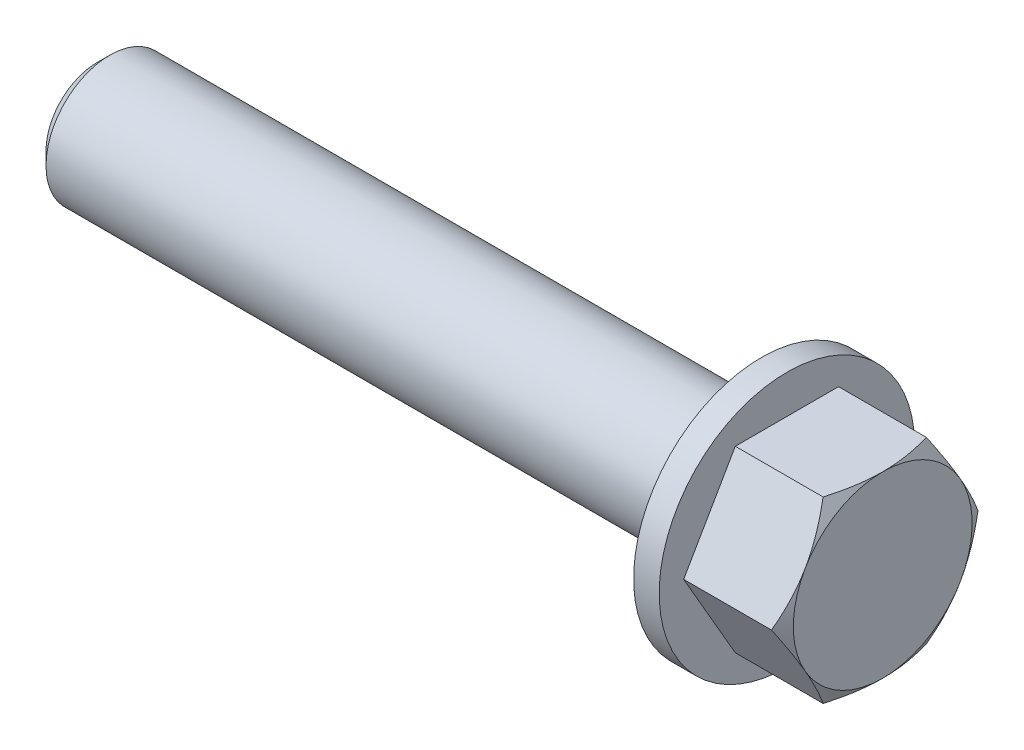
from build123d import *

# Parameters (mm, degrees)
BASE_EXTRUSION_DEPTH = 7.5
ESQUISSE2_R          = 5
BOSS_EXTRU_1_DEPTH   = 54
CHANFREIN1_SIZE      = 1
ESQUISSE4_W          = 2
ESQUISSE4_H          = 10
ESQUISSE5_W          = 34
ESQUISSE5_H          = 5


with BuildPart() as part:
    # Esquisse1 → Base-Extrusion (new body)
    with BuildSketch(Plane(origin=(0, 0, 0), x_dir=(0, 0, -1), z_dir=(1, 0, 0))):
        Polygon((8.082903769, 0), (4.041451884, 7), (-4.041451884, 7), (-8.082903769, 0), (-4.041451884, -7), (4.041451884, -7), align=None)
    extrude(amount=BASE_EXTRUSION_DEPTH)

    # Esquisse2 → Boss.-Extru.1 (add)
    with BuildSketch(Plane.ZY):
        Circle(ESQUISSE2_R)
    extrude(amount=BOSS_EXTRU_1_DEPTH)

    # Esquisse3 → Enl_vement de mati_re-R_volution1 (revolve, cut)
    with BuildSketch(Plane.XY):
        Polygon((7.5, -7), (0, -19.990381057), (7.5, -19.990381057), align=None)
    revolve(axis=Axis((0, 0, 0), (1, 0, 0)), mode=Mode.SUBTRACT)

    # Chanfrein1
    chanfrein1_edges = [part.edges().sort_by_distance(p)[0] for p in [
        (-54, 0, -5),
    ]]
    chamfer(chanfrein1_edges, length=CHANFREIN1_SIZE)

    # Esquisse4 → R_volution1 (revolve)
    with BuildSketch(Plane.XY, mode=Mode.PRIVATE) as r_volution1_sk:
        with Locations((-1, 5)):
            Rectangle(ESQUISSE4_W, ESQUISSE4_H)
    revolve(r_volution1_sk.sketch.rotate(Axis((0, 0, 0), (-1, 0, 0)), 90), axis=Axis((0, 0, 0), (-1, 0, 0)))

    # Esquisse5 → R_volution2 (revolve)
    with BuildSketch(Plane.XY):
        with Locations((-19, 2.5)):
            Rectangle(ESQUISSE5_W, ESQUISSE5_H)
    revolve(axis=Axis((0, 0, 0), (-1, 0, 0)))


solid = part.part
